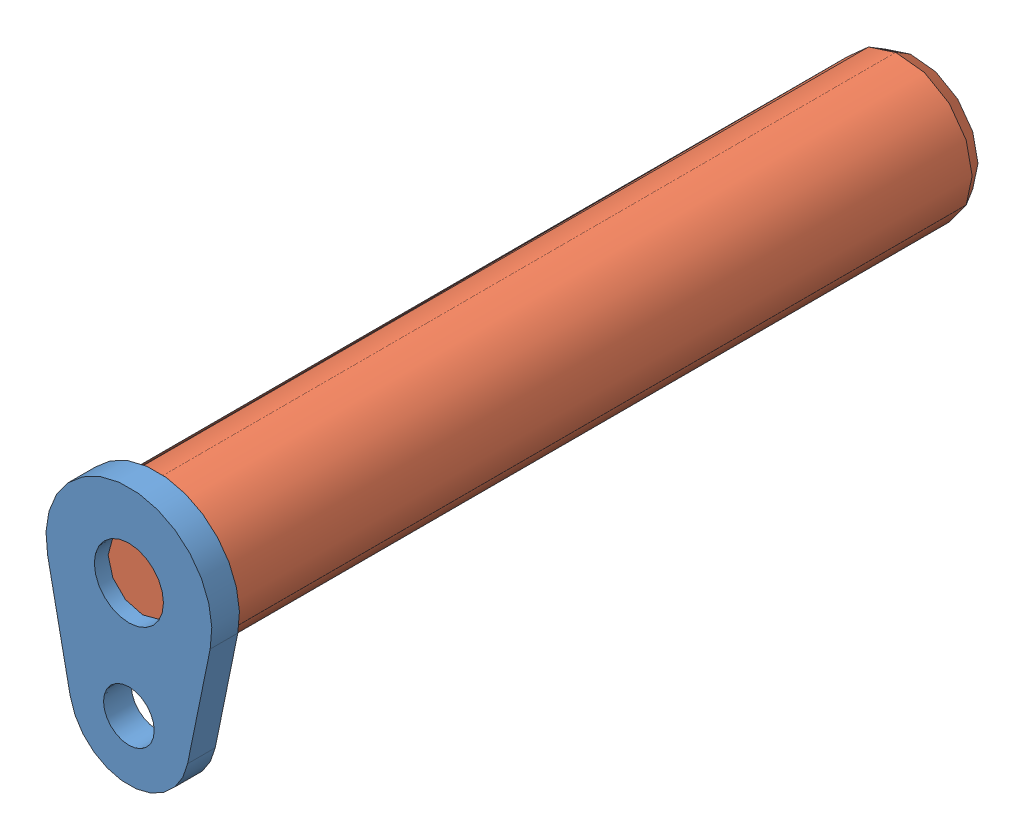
SolidWorks assembly 098 AXE POINT FIXE.SLDASM, configuration Défaut (file format 3100). Lengths in mm.
Overall size (36 56 171).
2 component instances, 2 part files, 2 mates.
Components (placement in the parent):
- 098A-1: 098A.SLDPRT [Défaut] at (-5.4561 2.9187 0) size (36 56 6)
- 098B-1: 098B.SLDPRT [Défaut] at (-5.4561 2.9187 3) x (0 0 -1) z (1 0 0) size (168 30 30)
Mates (geometry in assembly coordinates):
- Coaxiale1: concentric anti-aligned: cylinder of 098A-1; unknown of 098B-1
- Coïncidente1: coincident anti-aligned: plane of 098A-1 through (-5.4561 2.9187 0) normal (0 0 -1); unknown of 098B-1
